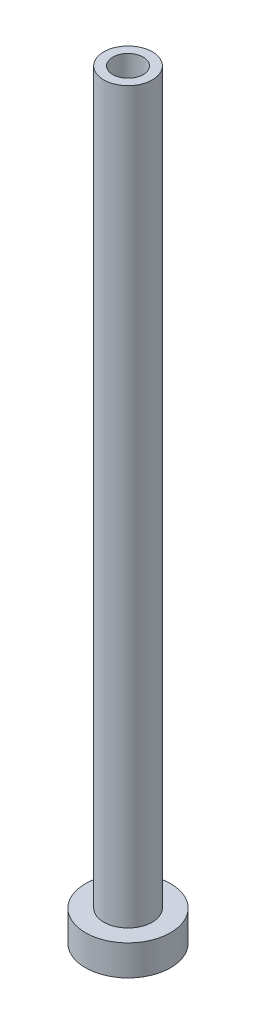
ISO-10303-21;
HEADER;
FILE_DESCRIPTION(('STEP AP214'),'2;1');
FILE_NAME('part.step','',(''),(''),'','','');
FILE_SCHEMA(('AUTOMOTIVE_DESIGN { 1 0 10303 214 1 1 1 1 }'));
ENDSEC;
DATA;
#1=APPLICATION_CONTEXT('core data for automotive mechanical design processes');
#2=APPLICATION_PROTOCOL_DEFINITION('international standard','automotive_design',2000,#1);
#3=PRODUCT_CONTEXT('',#1,'mechanical');
#4=PRODUCT('Part','Part','',(#3));
#5=PRODUCT_RELATED_PRODUCT_CATEGORY('part','',(#4));
#6=PRODUCT_DEFINITION_FORMATION('','',#4);
#7=PRODUCT_DEFINITION_CONTEXT('part definition',#1,'design');
#8=PRODUCT_DEFINITION('design','',#6,#7);
#9=PRODUCT_DEFINITION_SHAPE('','',#8);
#10=(LENGTH_UNIT() NAMED_UNIT(*) SI_UNIT(.MILLI.,.METRE.));
#11=(NAMED_UNIT(*) PLANE_ANGLE_UNIT() SI_UNIT($,.RADIAN.));
#12=(NAMED_UNIT(*) SI_UNIT($,.STERADIAN.) SOLID_ANGLE_UNIT());
#13=UNCERTAINTY_MEASURE_WITH_UNIT(LENGTH_MEASURE(1.E-05),#10,'distance_accuracy_value','');
#14=(GEOMETRIC_REPRESENTATION_CONTEXT(3) GLOBAL_UNCERTAINTY_ASSIGNED_CONTEXT((#13)) GLOBAL_UNIT_ASSIGNED_CONTEXT((#10,
#11,#12)) REPRESENTATION_CONTEXT('',''));
#15=CARTESIAN_POINT('',(0.,0.,0.));
#16=DIRECTION('',(0.,0.,1.));
#17=DIRECTION('',(1.,0.,0.));
#18=AXIS2_PLACEMENT_3D('',#15,#16,#17);
#19=CARTESIAN_POINT('',(0.,0.,0.));
#20=DIRECTION('',(0.,-1.,0.));
#21=DIRECTION('',(0.,0.,-1.));
#22=AXIS2_PLACEMENT_3D('',#19,#20,#21);
#23=CYLINDRICAL_SURFACE('',#22,7.);
#24=CARTESIAN_POINT('',(0.,-5.,0.));
#25=DIRECTION('',(0.,-1.,0.));
#26=DIRECTION('',(0.,0.,-1.));
#27=AXIS2_PLACEMENT_3D('',#24,#25,#26);
#28=CIRCLE('',#27,7.);
#29=CARTESIAN_POINT('',(0.,-5.,-7.));
#30=VERTEX_POINT('',#29);
#31=EDGE_CURVE('E42',#30,#30,#28,.T.);
#32=ORIENTED_EDGE('',*,*,#31,.F.);
#33=EDGE_LOOP('',(#32));
#34=FACE_BOUND('',#33,.T.);
#35=CARTESIAN_POINT('',(0.,0.,0.));
#36=DIRECTION('',(0.,-1.,0.));
#37=DIRECTION('',(0.,0.,-1.));
#38=AXIS2_PLACEMENT_3D('',#35,#36,#37);
#39=CIRCLE('',#38,7.);
#40=CARTESIAN_POINT('',(0.,0.,-7.));
#41=VERTEX_POINT('',#40);
#42=EDGE_CURVE('E9',#41,#41,#39,.T.);
#43=ORIENTED_EDGE('',*,*,#42,.T.);
#44=EDGE_LOOP('',(#43));
#45=FACE_BOUND('',#44,.T.);
#46=ADVANCED_FACE('F14',(#34,#45),#23,.T.);
#47=CARTESIAN_POINT('',(-7.,0.,0.));
#48=DIRECTION('',(0.,-1.,0.));
#49=DIRECTION('',(0.,0.,-1.));
#50=AXIS2_PLACEMENT_3D('',#47,#48,#49);
#51=PLANE('',#50);
#52=ORIENTED_EDGE('',*,*,#42,.F.);
#53=EDGE_LOOP('',(#52));
#54=FACE_BOUND('',#53,.T.);
#55=CARTESIAN_POINT('',(0.,0.,0.));
#56=DIRECTION('',(0.,-1.,0.));
#57=DIRECTION('',(0.,0.,-1.));
#58=AXIS2_PLACEMENT_3D('',#55,#56,#57);
#59=CIRCLE('',#58,4.);
#60=CARTESIAN_POINT('',(0.,0.,-4.));
#61=VERTEX_POINT('',#60);
#62=EDGE_CURVE('E20',#61,#61,#59,.T.);
#63=ORIENTED_EDGE('',*,*,#62,.T.);
#64=EDGE_LOOP('',(#63));
#65=FACE_BOUND('',#64,.T.);
#66=ADVANCED_FACE('F49',(#54,#65),#51,.F.);
#67=CARTESIAN_POINT('',(0.,0.,0.));
#68=DIRECTION('',(0.,-1.,0.));
#69=DIRECTION('',(0.,0.,-1.));
#70=AXIS2_PLACEMENT_3D('',#67,#68,#69);
#71=CYLINDRICAL_SURFACE('',#70,4.);
#72=ORIENTED_EDGE('',*,*,#62,.F.);
#73=EDGE_LOOP('',(#72));
#74=FACE_BOUND('',#73,.T.);
#75=CARTESIAN_POINT('',(0.,120.,0.));
#76=DIRECTION('',(0.,-1.,0.));
#77=DIRECTION('',(0.,0.,-1.));
#78=AXIS2_PLACEMENT_3D('',#75,#76,#77);
#79=CIRCLE('',#78,4.);
#80=CARTESIAN_POINT('',(0.,120.,-4.));
#81=VERTEX_POINT('',#80);
#82=EDGE_CURVE('E24',#81,#81,#79,.T.);
#83=ORIENTED_EDGE('',*,*,#82,.T.);
#84=EDGE_LOOP('',(#83));
#85=FACE_BOUND('',#84,.T.);
#86=ADVANCED_FACE('F55',(#74,#85),#71,.T.);
#87=CARTESIAN_POINT('',(-4.,120.,0.));
#88=DIRECTION('',(0.,-1.,0.));
#89=DIRECTION('',(0.,0.,-1.));
#90=AXIS2_PLACEMENT_3D('',#87,#88,#89);
#91=PLANE('',#90);
#92=ORIENTED_EDGE('',*,*,#82,.F.);
#93=EDGE_LOOP('',(#92));
#94=FACE_BOUND('',#93,.T.);
#95=CARTESIAN_POINT('',(0.,120.,0.));
#96=DIRECTION('',(0.,-1.,0.));
#97=DIRECTION('',(0.,0.,-1.));
#98=AXIS2_PLACEMENT_3D('',#95,#96,#97);
#99=CIRCLE('',#98,2.5);
#100=CARTESIAN_POINT('',(0.,120.,-2.5));
#101=VERTEX_POINT('',#100);
#102=EDGE_CURVE('E28',#101,#101,#99,.T.);
#103=ORIENTED_EDGE('',*,*,#102,.T.);
#104=EDGE_LOOP('',(#103));
#105=FACE_BOUND('',#104,.T.);
#106=ADVANCED_FACE('F61',(#94,#105),#91,.F.);
#107=CARTESIAN_POINT('',(0.,0.,0.));
#108=DIRECTION('',(0.,-1.,0.));
#109=DIRECTION('',(0.,0.,-1.));
#110=AXIS2_PLACEMENT_3D('',#107,#108,#109);
#111=CYLINDRICAL_SURFACE('',#110,2.5);
#112=ORIENTED_EDGE('',*,*,#102,.F.);
#113=EDGE_LOOP('',(#112));
#114=FACE_BOUND('',#113,.T.);
#115=CARTESIAN_POINT('',(0.,75.,0.));
#116=DIRECTION('',(0.,-1.,0.));
#117=DIRECTION('',(0.,0.,-1.));
#118=AXIS2_PLACEMENT_3D('',#115,#116,#117);
#119=CIRCLE('',#118,2.5);
#120=CARTESIAN_POINT('',(0.,75.,-2.5));
#121=VERTEX_POINT('',#120);
#122=EDGE_CURVE('E33',#121,#121,#119,.T.);
#123=ORIENTED_EDGE('',*,*,#122,.T.);
#124=EDGE_LOOP('',(#123));
#125=FACE_BOUND('',#124,.T.);
#126=ADVANCED_FACE('F67',(#114,#125),#111,.F.);
#127=CARTESIAN_POINT('',(0.,74.75,0.));
#128=DIRECTION('',(0.,-1.,0.));
#129=DIRECTION('',(0.,0.,-1.));
#130=AXIS2_PLACEMENT_3D('',#127,#128,#129);
#131=CONICAL_SURFACE('',#130,2.75,0.785398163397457);
#132=ORIENTED_EDGE('',*,*,#122,.F.);
#133=EDGE_LOOP('',(#132));
#134=FACE_BOUND('',#133,.T.);
#135=CARTESIAN_POINT('',(0.,74.75,0.));
#136=DIRECTION('',(0.,-1.,0.));
#137=DIRECTION('',(0.,0.,-1.));
#138=AXIS2_PLACEMENT_3D('',#135,#136,#137);
#139=CIRCLE('',#138,2.75);
#140=CARTESIAN_POINT('',(0.,74.75,-2.75));
#141=VERTEX_POINT('',#140);
#142=EDGE_CURVE('E36',#141,#141,#139,.T.);
#143=ORIENTED_EDGE('',*,*,#142,.T.);
#144=EDGE_LOOP('',(#143));
#145=FACE_BOUND('',#144,.T.);
#146=ADVANCED_FACE('F71',(#134,#145),#131,.F.);
#147=CARTESIAN_POINT('',(0.,0.,0.));
#148=DIRECTION('',(0.,-1.,0.));
#149=DIRECTION('',(0.,0.,-1.));
#150=AXIS2_PLACEMENT_3D('',#147,#148,#149);
#151=CYLINDRICAL_SURFACE('',#150,2.75);
#152=ORIENTED_EDGE('',*,*,#142,.F.);
#153=EDGE_LOOP('',(#152));
#154=FACE_BOUND('',#153,.T.);
#155=CARTESIAN_POINT('',(0.,-5.,0.));
#156=DIRECTION('',(0.,-1.,0.));
#157=DIRECTION('',(0.,0.,-1.));
#158=AXIS2_PLACEMENT_3D('',#155,#156,#157);
#159=CIRCLE('',#158,2.75);
#160=CARTESIAN_POINT('',(0.,-5.,-2.75));
#161=VERTEX_POINT('',#160);
#162=EDGE_CURVE('E39',#161,#161,#159,.T.);
#163=ORIENTED_EDGE('',*,*,#162,.T.);
#164=EDGE_LOOP('',(#163));
#165=FACE_BOUND('',#164,.T.);
#166=ADVANCED_FACE('F75',(#154,#165),#151,.F.);
#167=CARTESIAN_POINT('',(-2.75,-5.,0.));
#168=DIRECTION('',(0.,1.,0.));
#169=DIRECTION('',(0.,0.,1.));
#170=AXIS2_PLACEMENT_3D('',#167,#168,#169);
#171=PLANE('',#170);
#172=ORIENTED_EDGE('',*,*,#162,.F.);
#173=EDGE_LOOP('',(#172));
#174=FACE_BOUND('',#173,.T.);
#175=ORIENTED_EDGE('',*,*,#31,.T.);
#176=EDGE_LOOP('',(#175));
#177=FACE_BOUND('',#176,.T.);
#178=ADVANCED_FACE('F46',(#174,#177),#171,.F.);
#179=CLOSED_SHELL('',(#46,#66,#86,#106,#126,#146,#166,#178));
#180=MANIFOLD_SOLID_BREP('B1',#179);
#181=ADVANCED_BREP_SHAPE_REPRESENTATION('',(#18,#180),#14);
#182=SHAPE_DEFINITION_REPRESENTATION(#9,#181);
ENDSEC;
END-ISO-10303-21;
